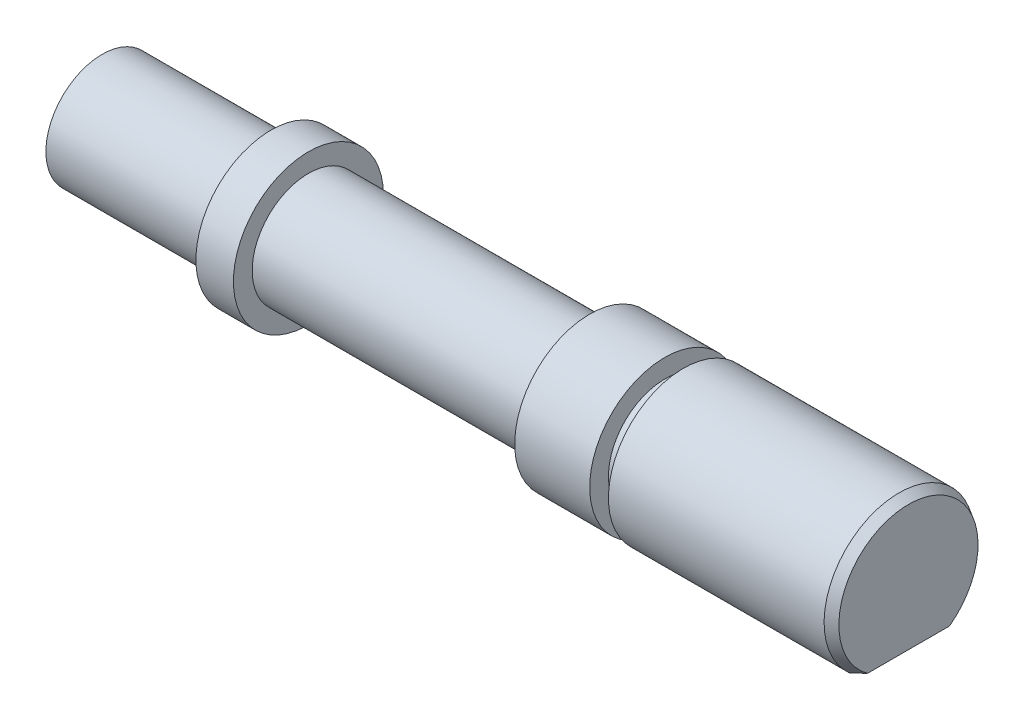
ISO-10303-21;
HEADER;
FILE_DESCRIPTION(('STEP AP214'),'2;1');
FILE_NAME('part.step','',(''),(''),'','','');
FILE_SCHEMA(('AUTOMOTIVE_DESIGN { 1 0 10303 214 1 1 1 1 }'));
ENDSEC;
DATA;
#1=APPLICATION_CONTEXT('core data for automotive mechanical design processes');
#2=APPLICATION_PROTOCOL_DEFINITION('international standard','automotive_design',2000,#1);
#3=PRODUCT_CONTEXT('',#1,'mechanical');
#4=PRODUCT('Part','Part','',(#3));
#5=PRODUCT_RELATED_PRODUCT_CATEGORY('part','',(#4));
#6=PRODUCT_DEFINITION_FORMATION('','',#4);
#7=PRODUCT_DEFINITION_CONTEXT('part definition',#1,'design');
#8=PRODUCT_DEFINITION('design','',#6,#7);
#9=PRODUCT_DEFINITION_SHAPE('','',#8);
#10=(LENGTH_UNIT() NAMED_UNIT(*) SI_UNIT(.MILLI.,.METRE.));
#11=(NAMED_UNIT(*) PLANE_ANGLE_UNIT() SI_UNIT($,.RADIAN.));
#12=(NAMED_UNIT(*) SI_UNIT($,.STERADIAN.) SOLID_ANGLE_UNIT());
#13=UNCERTAINTY_MEASURE_WITH_UNIT(LENGTH_MEASURE(1.E-05),#10,'distance_accuracy_value','');
#14=(GEOMETRIC_REPRESENTATION_CONTEXT(3) GLOBAL_UNCERTAINTY_ASSIGNED_CONTEXT((#13)) GLOBAL_UNIT_ASSIGNED_CONTEXT((#10,
#11,#12)) REPRESENTATION_CONTEXT('',''));
#15=CARTESIAN_POINT('',(0.,0.,0.));
#16=DIRECTION('',(0.,0.,1.));
#17=DIRECTION('',(1.,0.,0.));
#18=AXIS2_PLACEMENT_3D('',#15,#16,#17);
#19=CARTESIAN_POINT('',(0.,0.,0.));
#20=DIRECTION('',(1.,0.,0.));
#21=DIRECTION('',(0.,0.,-1.));
#22=AXIS2_PLACEMENT_3D('',#19,#20,#21);
#23=PLANE('',#22);
#24=CARTESIAN_POINT('',(0.,0.,0.));
#25=DIRECTION('',(1.,0.,0.));
#26=DIRECTION('',(0.,0.,-1.));
#27=AXIS2_PLACEMENT_3D('',#24,#25,#26);
#28=CIRCLE('',#27,3.);
#29=CARTESIAN_POINT('',(0.,0.,-3.));
#30=VERTEX_POINT('',#29);
#31=EDGE_CURVE('E78',#30,#30,#28,.T.);
#32=ORIENTED_EDGE('',*,*,#31,.F.);
#33=EDGE_LOOP('',(#32));
#34=FACE_BOUND('',#33,.T.);
#35=ADVANCED_FACE('F33',(#34),#23,.F.);
#36=CARTESIAN_POINT('',(52.5,0.,0.));
#37=DIRECTION('',(1.,0.,0.));
#38=DIRECTION('',(0.,0.,-1.));
#39=AXIS2_PLACEMENT_3D('',#36,#37,#38);
#40=CYLINDRICAL_SURFACE('',#39,3.);
#41=CARTESIAN_POINT('',(9.,0.,0.));
#42=DIRECTION('',(1.,0.,0.));
#43=DIRECTION('',(0.,0.,-1.));
#44=AXIS2_PLACEMENT_3D('',#41,#42,#43);
#45=CIRCLE('',#44,3.);
#46=CARTESIAN_POINT('',(9.,0.,-3.));
#47=VERTEX_POINT('',#46);
#48=EDGE_CURVE('E82',#47,#47,#45,.T.);
#49=ORIENTED_EDGE('',*,*,#48,.F.);
#50=EDGE_LOOP('',(#49));
#51=FACE_BOUND('',#50,.T.);
#52=ORIENTED_EDGE('',*,*,#31,.T.);
#53=EDGE_LOOP('',(#52));
#54=FACE_BOUND('',#53,.T.);
#55=ADVANCED_FACE('F108',(#51,#54),#40,.T.);
#56=CARTESIAN_POINT('',(9.,3.,0.));
#57=DIRECTION('',(1.,0.,0.));
#58=DIRECTION('',(0.,0.,-1.));
#59=AXIS2_PLACEMENT_3D('',#56,#57,#58);
#60=PLANE('',#59);
#61=CARTESIAN_POINT('',(9.,0.,0.));
#62=DIRECTION('',(1.,0.,0.));
#63=DIRECTION('',(0.,0.,-1.));
#64=AXIS2_PLACEMENT_3D('',#61,#62,#63);
#65=CIRCLE('',#64,4.);
#66=CARTESIAN_POINT('',(9.,0.,-4.));
#67=VERTEX_POINT('',#66);
#68=EDGE_CURVE('E285',#67,#67,#65,.T.);
#69=ORIENTED_EDGE('',*,*,#68,.F.);
#70=EDGE_LOOP('',(#69));
#71=FACE_BOUND('',#70,.T.);
#72=ORIENTED_EDGE('',*,*,#48,.T.);
#73=EDGE_LOOP('',(#72));
#74=FACE_BOUND('',#73,.T.);
#75=ADVANCED_FACE('F113',(#71,#74),#60,.F.);
#76=CARTESIAN_POINT('',(52.5,0.,0.));
#77=DIRECTION('',(1.,0.,0.));
#78=DIRECTION('',(0.,0.,-1.));
#79=AXIS2_PLACEMENT_3D('',#76,#77,#78);
#80=CYLINDRICAL_SURFACE('',#79,4.);
#81=CARTESIAN_POINT('',(11.,0.,0.));
#82=DIRECTION('',(1.,0.,0.));
#83=DIRECTION('',(0.,0.,-1.));
#84=AXIS2_PLACEMENT_3D('',#81,#82,#83);
#85=CIRCLE('',#84,4.);
#86=CARTESIAN_POINT('',(11.,0.,-4.));
#87=VERTEX_POINT('',#86);
#88=EDGE_CURVE('E282',#87,#87,#85,.T.);
#89=ORIENTED_EDGE('',*,*,#88,.F.);
#90=EDGE_LOOP('',(#89));
#91=FACE_BOUND('',#90,.T.);
#92=ORIENTED_EDGE('',*,*,#68,.T.);
#93=EDGE_LOOP('',(#92));
#94=FACE_BOUND('',#93,.T.);
#95=ADVANCED_FACE('F120',(#91,#94),#80,.T.);
#96=CARTESIAN_POINT('',(11.,4.,0.));
#97=DIRECTION('',(-1.,0.,0.));
#98=DIRECTION('',(0.,0.,1.));
#99=AXIS2_PLACEMENT_3D('',#96,#97,#98);
#100=PLANE('',#99);
#101=CARTESIAN_POINT('',(11.,0.,0.));
#102=DIRECTION('',(1.,0.,0.));
#103=DIRECTION('',(0.,0.,-1.));
#104=AXIS2_PLACEMENT_3D('',#101,#102,#103);
#105=CIRCLE('',#104,3.);
#106=CARTESIAN_POINT('',(11.,0.,-3.));
#107=VERTEX_POINT('',#106);
#108=EDGE_CURVE('E279',#107,#107,#105,.T.);
#109=ORIENTED_EDGE('',*,*,#108,.F.);
#110=EDGE_LOOP('',(#109));
#111=FACE_BOUND('',#110,.T.);
#112=ORIENTED_EDGE('',*,*,#88,.T.);
#113=EDGE_LOOP('',(#112));
#114=FACE_BOUND('',#113,.T.);
#115=ADVANCED_FACE('F127',(#111,#114),#100,.F.);
#116=CARTESIAN_POINT('',(52.5,0.,0.));
#117=DIRECTION('',(1.,0.,0.));
#118=DIRECTION('',(0.,0.,-1.));
#119=AXIS2_PLACEMENT_3D('',#116,#117,#118);
#120=CYLINDRICAL_SURFACE('',#119,3.);
#121=CARTESIAN_POINT('',(26.,0.,0.));
#122=DIRECTION('',(1.,0.,0.));
#123=DIRECTION('',(0.,0.,-1.));
#124=AXIS2_PLACEMENT_3D('',#121,#122,#123);
#125=CIRCLE('',#124,3.);
#126=CARTESIAN_POINT('',(26.,0.,-3.));
#127=VERTEX_POINT('',#126);
#128=EDGE_CURVE('E276',#127,#127,#125,.T.);
#129=ORIENTED_EDGE('',*,*,#128,.F.);
#130=EDGE_LOOP('',(#129));
#131=FACE_BOUND('',#130,.T.);
#132=ORIENTED_EDGE('',*,*,#108,.T.);
#133=EDGE_LOOP('',(#132));
#134=FACE_BOUND('',#133,.T.);
#135=ADVANCED_FACE('F131',(#131,#134),#120,.T.);
#136=CARTESIAN_POINT('',(26.,3.,0.));
#137=DIRECTION('',(1.,0.,0.));
#138=DIRECTION('',(0.,0.,-1.));
#139=AXIS2_PLACEMENT_3D('',#136,#137,#138);
#140=PLANE('',#139);
#141=CARTESIAN_POINT('',(26.,0.,0.));
#142=DIRECTION('',(1.,0.,0.));
#143=DIRECTION('',(0.,0.,-1.));
#144=AXIS2_PLACEMENT_3D('',#141,#142,#143);
#145=CIRCLE('',#144,4.);
#146=CARTESIAN_POINT('',(26.,0.,-4.));
#147=VERTEX_POINT('',#146);
#148=EDGE_CURVE('E273',#147,#147,#145,.T.);
#149=ORIENTED_EDGE('',*,*,#148,.F.);
#150=EDGE_LOOP('',(#149));
#151=FACE_BOUND('',#150,.T.);
#152=ORIENTED_EDGE('',*,*,#128,.T.);
#153=EDGE_LOOP('',(#152));
#154=FACE_BOUND('',#153,.T.);
#155=ADVANCED_FACE('F135',(#151,#154),#140,.F.);
#156=CARTESIAN_POINT('',(52.5,0.,0.));
#157=DIRECTION('',(1.,0.,0.));
#158=DIRECTION('',(0.,0.,-1.));
#159=AXIS2_PLACEMENT_3D('',#156,#157,#158);
#160=CYLINDRICAL_SURFACE('',#159,4.);
#161=CARTESIAN_POINT('',(30.,0.,0.));
#162=DIRECTION('',(1.,0.,0.));
#163=DIRECTION('',(0.,0.,-1.));
#164=AXIS2_PLACEMENT_3D('',#161,#162,#163);
#165=CIRCLE('',#164,4.);
#166=CARTESIAN_POINT('',(30.,0.,-4.));
#167=VERTEX_POINT('',#166);
#168=EDGE_CURVE('E270',#167,#167,#165,.T.);
#169=ORIENTED_EDGE('',*,*,#168,.F.);
#170=EDGE_LOOP('',(#169));
#171=FACE_BOUND('',#170,.T.);
#172=ORIENTED_EDGE('',*,*,#148,.T.);
#173=EDGE_LOOP('',(#172));
#174=FACE_BOUND('',#173,.T.);
#175=ADVANCED_FACE('F139',(#171,#174),#160,.T.);
#176=CARTESIAN_POINT('',(30.,4.,0.));
#177=DIRECTION('',(-1.,0.,0.));
#178=DIRECTION('',(0.,0.,1.));
#179=AXIS2_PLACEMENT_3D('',#176,#177,#178);
#180=PLANE('',#179);
#181=CARTESIAN_POINT('',(30.,0.,0.));
#182=DIRECTION('',(1.,0.,0.));
#183=DIRECTION('',(0.,0.,-1.));
#184=AXIS2_PLACEMENT_3D('',#181,#182,#183);
#185=CIRCLE('',#184,3.);
#186=CARTESIAN_POINT('',(30.,0.,-3.));
#187=VERTEX_POINT('',#186);
#188=EDGE_CURVE('E262',#187,#187,#185,.T.);
#189=ORIENTED_EDGE('',*,*,#188,.F.);
#190=EDGE_LOOP('',(#189));
#191=FACE_BOUND('',#190,.T.);
#192=ORIENTED_EDGE('',*,*,#168,.T.);
#193=EDGE_LOOP('',(#192));
#194=FACE_BOUND('',#193,.T.);
#195=ADVANCED_FACE('F143',(#191,#194),#180,.F.);
#196=CARTESIAN_POINT('',(52.5,0.,0.));
#197=DIRECTION('',(1.,0.,0.));
#198=DIRECTION('',(0.,0.,-1.));
#199=AXIS2_PLACEMENT_3D('',#196,#197,#198);
#200=CYLINDRICAL_SURFACE('',#199,3.);
#201=CARTESIAN_POINT('',(31.,0.,0.));
#202=DIRECTION('',(1.,0.,0.));
#203=DIRECTION('',(0.,0.,-1.));
#204=AXIS2_PLACEMENT_3D('',#201,#202,#203);
#205=CIRCLE('',#204,3.);
#206=CARTESIAN_POINT('',(31.,0.,-3.));
#207=VERTEX_POINT('',#206);
#208=EDGE_CURVE('E259',#207,#207,#205,.T.);
#209=ORIENTED_EDGE('',*,*,#208,.F.);
#210=EDGE_LOOP('',(#209));
#211=FACE_BOUND('',#210,.T.);
#212=ORIENTED_EDGE('',*,*,#188,.T.);
#213=EDGE_LOOP('',(#212));
#214=FACE_BOUND('',#213,.T.);
#215=ADVANCED_FACE('F147',(#211,#214),#200,.T.);
#216=CARTESIAN_POINT('',(31.,3.,0.));
#217=DIRECTION('',(1.,0.,0.));
#218=DIRECTION('',(0.,0.,-1.));
#219=AXIS2_PLACEMENT_3D('',#216,#217,#218);
#220=PLANE('',#219);
#221=CARTESIAN_POINT('',(31.,0.,0.));
#222=DIRECTION('',(1.,0.,0.));
#223=DIRECTION('',(0.,0.,-1.));
#224=AXIS2_PLACEMENT_3D('',#221,#222,#223);
#225=CIRCLE('',#224,4.);
#226=CARTESIAN_POINT('',(31.,0.,-4.));
#227=VERTEX_POINT('',#226);
#228=EDGE_CURVE('E258',#227,#227,#225,.T.);
#229=ORIENTED_EDGE('',*,*,#228,.F.);
#230=EDGE_LOOP('',(#229));
#231=FACE_BOUND('',#230,.T.);
#232=ORIENTED_EDGE('',*,*,#208,.T.);
#233=EDGE_LOOP('',(#232));
#234=FACE_BOUND('',#233,.T.);
#235=ADVANCED_FACE('F151',(#231,#234),#220,.F.);
#236=CARTESIAN_POINT('',(52.5,0.,0.));
#237=DIRECTION('',(1.,0.,0.));
#238=DIRECTION('',(0.,0.,-1.));
#239=AXIS2_PLACEMENT_3D('',#236,#237,#238);
#240=CYLINDRICAL_SURFACE('',#239,4.);
#241=CARTESIAN_POINT('',(33.0000000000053,0.,0.));
#242=DIRECTION('',(-1.,0.,0.));
#243=DIRECTION('',(0.,0.,1.));
#244=AXIS2_PLACEMENT_3D('',#241,#242,#243);
#245=CIRCLE('',#244,4.);
#246=CARTESIAN_POINT('',(33.0000000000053,-3.,-2.64575131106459));
#247=VERTEX_POINT('',#246);
#248=CARTESIAN_POINT('',(33.0000000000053,-3.,2.64575131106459));
#249=VERTEX_POINT('',#248);
#250=EDGE_CURVE('E11',#247,#249,#245,.T.);
#251=ORIENTED_EDGE('',*,*,#250,.T.);
#252=DIRECTION('',(1.,0.,0.));
#253=VECTOR('',#252,1.);
#254=CARTESIAN_POINT('',(52.5,-3.,2.64575131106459));
#255=LINE('',#254,#253);
#256=CARTESIAN_POINT('',(42.5000000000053,-3.,2.64575131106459));
#257=VERTEX_POINT('',#256);
#258=EDGE_CURVE('E264',#249,#257,#255,.T.);
#259=ORIENTED_EDGE('',*,*,#258,.T.);
#260=CARTESIAN_POINT('',(42.5000000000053,0.,0.));
#261=DIRECTION('',(-1.,0.,0.));
#262=DIRECTION('',(0.,0.,1.));
#263=AXIS2_PLACEMENT_3D('',#260,#261,#262);
#264=CIRCLE('',#263,4.);
#265=CARTESIAN_POINT('',(42.5000000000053,-3.,-2.64575131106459));
#266=VERTEX_POINT('',#265);
#267=EDGE_CURVE('E77',#257,#266,#264,.T.);
#268=ORIENTED_EDGE('',*,*,#267,.T.);
#269=DIRECTION('',(1.,0.,0.));
#270=VECTOR('',#269,1.);
#271=CARTESIAN_POINT('',(52.5,-3.,-2.64575131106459));
#272=LINE('',#271,#270);
#273=EDGE_CURVE('E53',#266,#247,#272,.F.);
#274=ORIENTED_EDGE('',*,*,#273,.T.);
#275=EDGE_LOOP('',(#251,#259,#268,#274));
#276=FACE_BOUND('',#275,.T.);
#277=ORIENTED_EDGE('',*,*,#228,.T.);
#278=EDGE_LOOP('',(#277));
#279=FACE_BOUND('',#278,.T.);
#280=ADVANCED_FACE('F155',(#276,#279),#240,.T.);
#281=CARTESIAN_POINT('',(43.0000000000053,4.,0.));
#282=DIRECTION('',(-1.,0.,0.));
#283=DIRECTION('',(0.,0.,1.));
#284=AXIS2_PLACEMENT_3D('',#281,#282,#283);
#285=PLANE('',#284);
#286=CARTESIAN_POINT('',(43.0000000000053,0.,0.));
#287=DIRECTION('',(-1.,0.,0.));
#288=DIRECTION('',(0.,0.,1.));
#289=AXIS2_PLACEMENT_3D('',#286,#287,#288);
#290=CIRCLE('',#289,3.71132486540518);
#291=CARTESIAN_POINT('',(43.0000000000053,-3.,-2.18493300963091));
#292=VERTEX_POINT('',#291);
#293=CARTESIAN_POINT('',(43.0000000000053,-3.,2.18493300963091));
#294=VERTEX_POINT('',#293);
#295=EDGE_CURVE('E73',#292,#294,#290,.F.);
#296=ORIENTED_EDGE('',*,*,#295,.T.);
#297=DIRECTION('',(0.,0.,-1.));
#298=VECTOR('',#297,1.);
#299=CARTESIAN_POINT('',(43.0000000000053,-3.,3.5));
#300=LINE('',#299,#298);
#301=EDGE_CURVE('E47',#294,#292,#300,.T.);
#302=ORIENTED_EDGE('',*,*,#301,.T.);
#303=EDGE_LOOP('',(#296,#302));
#304=FACE_BOUND('',#303,.T.);
#305=ADVANCED_FACE('F72',(#304),#285,.F.);
#306=CARTESIAN_POINT('',(43.0000000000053,0.,0.));
#307=DIRECTION('',(-1.,0.,0.));
#308=DIRECTION('',(0.,0.,1.));
#309=AXIS2_PLACEMENT_3D('',#306,#307,#308);
#310=CONICAL_SURFACE('',#309,3.71132486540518,0.523598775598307);
#311=CARTESIAN_POINT('',(38.416343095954,-3.,-5.60538620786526));
#312=CARTESIAN_POINT('',(38.6001918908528,-3.,-5.4849761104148));
#313=CARTESIAN_POINT('',(38.783663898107,-3.,-5.36398521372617));
#314=CARTESIAN_POINT('',(39.1496559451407,-3.,-5.12053597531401));
#315=CARTESIAN_POINT('',(39.3321758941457,-3.,-4.99807749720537));
#316=CARTESIAN_POINT('',(39.6965989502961,-3.,-4.75102460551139));
#317=CARTESIAN_POINT('',(39.8784983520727,-3.,-4.62642471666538));
#318=CARTESIAN_POINT('',(40.2407821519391,-3.,-4.3750545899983));
#319=CARTESIAN_POINT('',(40.4211666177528,-3.,-4.24828444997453));
#320=CARTESIAN_POINT('',(40.7774866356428,-3.,-3.99380774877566));
#321=CARTESIAN_POINT('',(40.9534491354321,-3.,-3.86613900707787));
#322=CARTESIAN_POINT('',(41.302875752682,-3.,-3.60743015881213));
#323=CARTESIAN_POINT('',(41.4763399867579,-3.,-3.47639021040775));
#324=CARTESIAN_POINT('',(41.8196840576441,-3.,-3.21005131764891));
#325=CARTESIAN_POINT('',(41.9895675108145,-3.,-3.07475705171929));
#326=CARTESIAN_POINT('',(42.324499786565,-3.,-2.79833492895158));
#327=CARTESIAN_POINT('',(42.4895499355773,-3.,-2.65720869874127));
#328=CARTESIAN_POINT('',(42.7396777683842,-3.,-2.43224823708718));
#329=CARTESIAN_POINT('',(42.8272917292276,-3.,-2.35123982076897));
#330=CARTESIAN_POINT('',(42.999648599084,-3.,-2.18627005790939));
#331=CARTESIAN_POINT('',(43.0843924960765,-3.,-2.10230974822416));
#332=CARTESIAN_POINT('',(43.2504483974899,-3.,-1.93045624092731));
#333=CARTESIAN_POINT('',(43.3317474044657,-3.,-1.84255035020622));
#334=CARTESIAN_POINT('',(43.4499158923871,-3.,-1.70728447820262));
#335=CARTESIAN_POINT('',(43.4886997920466,-3.,-1.66159665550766));
#336=CARTESIAN_POINT('',(43.5647600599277,-3.,-1.56896308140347));
#337=CARTESIAN_POINT('',(43.6020359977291,-3.,-1.52201697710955));
#338=CARTESIAN_POINT('',(43.6384334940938,-3.,-1.47438502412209));
#339=B_SPLINE_CURVE_WITH_KNOTS('',3,(#311,#312,#313,#314,#315,#316,#317,#318,#319,#320,#321,
#322,#323,#324,#325,#326,#327,#328,#329,#330,#331,#332,#333,#334,#335,#336,#337,#338),
.UNSPECIFIED.,.F.,.F.,(4,2,2,2,2,2,2,2,2,2,2,2,2,4),(0.,0.659314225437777,1.31869020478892,
1.98012497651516,2.64153002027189,3.2936956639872,3.94583076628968,4.5972722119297,
5.24853317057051,5.60645461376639,5.9642515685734,6.32329616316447,6.50305649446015,
6.68286777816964),.UNSPECIFIED.);
#340=EDGE_CURVE('E40',#266,#292,#339,.T.);
#341=ORIENTED_EDGE('',*,*,#340,.F.);
#342=ORIENTED_EDGE('',*,*,#267,.F.);
#343=CARTESIAN_POINT('',(43.6384334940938,-3.,1.47438502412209));
#344=CARTESIAN_POINT('',(43.6020359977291,-3.,1.52201697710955));
#345=CARTESIAN_POINT('',(43.5647600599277,-3.,1.56896308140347));
#346=CARTESIAN_POINT('',(43.4886997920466,-3.,1.66159665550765));
#347=CARTESIAN_POINT('',(43.4499158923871,-3.,1.70728447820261));
#348=CARTESIAN_POINT('',(43.3317474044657,-3.,1.84255035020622));
#349=CARTESIAN_POINT('',(43.2504483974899,-3.,1.93045624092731));
#350=CARTESIAN_POINT('',(43.0843924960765,-3.,2.10230974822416));
#351=CARTESIAN_POINT('',(42.999648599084,-3.,2.18627005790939));
#352=CARTESIAN_POINT('',(42.8272917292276,-3.,2.35123982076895));
#353=CARTESIAN_POINT('',(42.7396777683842,-3.,2.43224823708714));
#354=CARTESIAN_POINT('',(42.4895499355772,-3.,2.65720869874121));
#355=CARTESIAN_POINT('',(42.324499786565,-3.,2.79833492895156));
#356=CARTESIAN_POINT('',(41.9895675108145,-3.,3.0747570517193));
#357=CARTESIAN_POINT('',(41.8196840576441,-3.,3.21005131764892));
#358=CARTESIAN_POINT('',(41.4763399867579,-3.,3.47639021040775));
#359=CARTESIAN_POINT('',(41.302875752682,-3.,3.60743015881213));
#360=CARTESIAN_POINT('',(40.9534491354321,-3.,3.86613900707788));
#361=CARTESIAN_POINT('',(40.7774866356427,-3.,3.99380774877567));
#362=CARTESIAN_POINT('',(40.4211666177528,-3.,4.24828444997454));
#363=CARTESIAN_POINT('',(40.2407821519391,-3.,4.3750545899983));
#364=CARTESIAN_POINT('',(39.8784983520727,-3.,4.62642471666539));
#365=CARTESIAN_POINT('',(39.6965989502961,-3.,4.75102460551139));
#366=CARTESIAN_POINT('',(39.3321758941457,-3.,4.99807749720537));
#367=CARTESIAN_POINT('',(39.1496559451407,-3.,5.12053597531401));
#368=CARTESIAN_POINT('',(38.783663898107,-3.,5.36398521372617));
#369=CARTESIAN_POINT('',(38.6001918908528,-3.,5.4849761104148));
#370=CARTESIAN_POINT('',(38.416343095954,-3.,5.60538620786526));
#371=B_SPLINE_CURVE_WITH_KNOTS('',3,(#343,#344,#345,#346,#347,#348,#349,#350,#351,#352,#353,
#354,#355,#356,#357,#358,#359,#360,#361,#362,#363,#364,#365,#366,#367,#368,#369,#370),
.UNSPECIFIED.,.F.,.F.,(4,2,2,2,2,2,2,2,2,2,2,2,2,4),(0.,0.179811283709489,0.35957161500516,
0.718616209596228,1.07641316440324,1.43433460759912,2.08559556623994,2.73703701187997,
3.38917211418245,4.04133775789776,4.70274280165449,5.36417757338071,6.02355355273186,
6.68286777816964),.UNSPECIFIED.);
#372=EDGE_CURVE('E69',#294,#257,#371,.T.);
#373=ORIENTED_EDGE('',*,*,#372,.F.);
#374=ORIENTED_EDGE('',*,*,#295,.F.);
#375=EDGE_LOOP('',(#341,#342,#373,#374));
#376=FACE_BOUND('',#375,.T.);
#377=ADVANCED_FACE('F76',(#376),#310,.T.);
#378=CARTESIAN_POINT('',(33.0000000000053,-5.,-3.5));
#379=DIRECTION('',(-1.,0.,0.));
#380=DIRECTION('',(0.,0.,1.));
#381=AXIS2_PLACEMENT_3D('',#378,#379,#380);
#382=PLANE('',#381);
#383=DIRECTION('',(0.,0.,1.));
#384=VECTOR('',#383,1.);
#385=CARTESIAN_POINT('',(33.0000000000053,-3.,-3.5));
#386=LINE('',#385,#384);
#387=EDGE_CURVE('E74',#247,#249,#386,.T.);
#388=ORIENTED_EDGE('',*,*,#387,.T.);
#389=ORIENTED_EDGE('',*,*,#250,.F.);
#390=EDGE_LOOP('',(#388,#389));
#391=FACE_BOUND('',#390,.T.);
#392=ADVANCED_FACE('F99',(#391),#382,.F.);
#393=CARTESIAN_POINT('',(43.0000000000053,-3.,3.5));
#394=DIRECTION('',(0.,1.,0.));
#395=DIRECTION('',(0.,0.,1.));
#396=AXIS2_PLACEMENT_3D('',#393,#394,#395);
#397=PLANE('',#396);
#398=ORIENTED_EDGE('',*,*,#340,.T.);
#399=ORIENTED_EDGE('',*,*,#301,.F.);
#400=ORIENTED_EDGE('',*,*,#372,.T.);
#401=ORIENTED_EDGE('',*,*,#258,.F.);
#402=ORIENTED_EDGE('',*,*,#387,.F.);
#403=ORIENTED_EDGE('',*,*,#273,.F.);
#404=EDGE_LOOP('',(#398,#399,#400,#401,#402,#403));
#405=FACE_BOUND('',#404,.T.);
#406=ADVANCED_FACE('F64',(#405),#397,.F.);
#407=CLOSED_SHELL('',(#35,#55,#75,#95,#115,#135,#155,#175,#195,#215,#235,#280,#305,#377,#392,#406));
#408=MANIFOLD_SOLID_BREP('B2',#407);
#409=ADVANCED_BREP_SHAPE_REPRESENTATION('',(#18,#408),#14);
#410=SHAPE_DEFINITION_REPRESENTATION(#9,#409);
ENDSEC;
END-ISO-10303-21;
